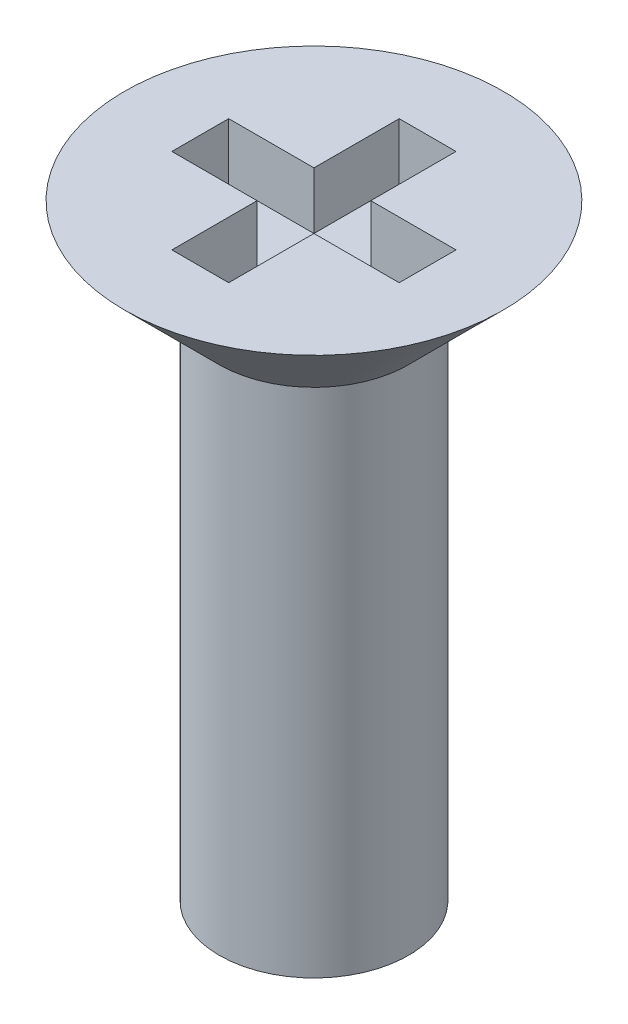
from build123d import *

# Parameters (mm, degrees)
SKETCH2_W              = 0.75
SKETCH2_H              = 1.5
PHILLIPS_DEPTH         = 0.75
PHILLIPS_PATTERN_COUNT = 4


with BuildPart() as part:
    # Sketch1 → FLATHEAD (revolve)
    with BuildSketch(Plane.XY, mode=Mode.PRIVATE) as flathead_sk:
        Polygon((0, 0), (1.25, 0), (1.25, 6.75), (2.5, 8), (0, 8), align=None)
    revolve(flathead_sk.sketch.rotate(Axis((0, 90.869303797, 0), (0, -1, 0)), 90), axis=Axis((0, 90.869303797, 0), (0, -1, 0)))

    # Sketch2 → PHILLIPS (cut)
    with BuildSketch(Plane(origin=(0, 8, 0), x_dir=(-1, 0, 0), z_dir=(0, 1, 0))):
        with Locations((0, 0.75)):
            Rectangle(SKETCH2_W, SKETCH2_H)
    phillips = extrude(amount=-PHILLIPS_DEPTH, mode=Mode.SUBTRACT)

    # PHILLIPS PATTERN: PHILLIPS ×4 about axis
    phillips_pattern_axis = Axis((0, 0, 0), (0, 1, 0))
    for i in range(1, PHILLIPS_PATTERN_COUNT):
        add(phillips.rotate(phillips_pattern_axis, i * 360 / PHILLIPS_PATTERN_COUNT), mode=Mode.SUBTRACT)


solid = part.part
